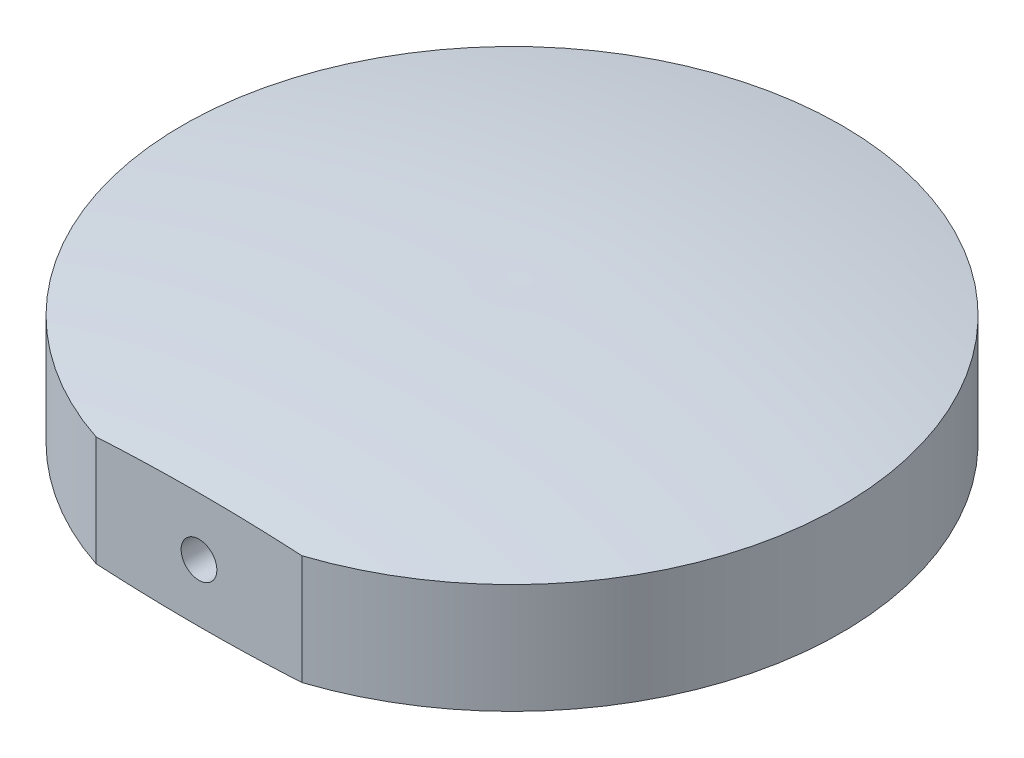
from build123d import *

# Parameters (mm, degrees)
SKETCH2_R          = 3.25
CUT_EXTRUDE1_DEPTH = 76.5
CUT_EXTRUDE2_DEPTH = 76.5


with BuildPart() as part:
    # Sketch1 → Revolve4 (revolve)
    with BuildSketch(Plane.XY, mode=Mode.PRIVATE) as revolve4_sk:
        with BuildLine():
            Line((0, -15), (0, 15))
            ThreePointArc((0, 15), (30.120495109, 13.945941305), (60, 10))
            Line((60, 10), (60, -10))
            ThreePointArc((60, -10), (30.120495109, -13.945941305), (0, -15))
        make_face()
    revolve(revolve4_sk.sketch.rotate(Axis((0, -15, 0), (0, 1, 0)), 90), axis=Axis((0, -15, 0), (0, 1, 0)))

    # Sketch2 → Cut-Extrude1 (cut, symmetric)
    with BuildSketch(Plane.XY):
        Circle(SKETCH2_R)
    extrude(amount=CUT_EXTRUDE1_DEPTH, both=True, mode=Mode.SUBTRACT)

    # Sketch3 → Cut-Extrude2 (cut, symmetric)
    with BuildSketch(Plane(origin=(0, 0, 0), x_dir=(1, 0, 0), z_dir=(0, 1, 0))):
        with BuildLine():
            Line((-18.734993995, -57), (18.734993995, -57))
            ThreePointArc((18.734993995, -57), (0, -60), (-18.734993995, -57))
        make_face()
    extrude(amount=CUT_EXTRUDE2_DEPTH, both=True, mode=Mode.SUBTRACT)


solid = part.part
